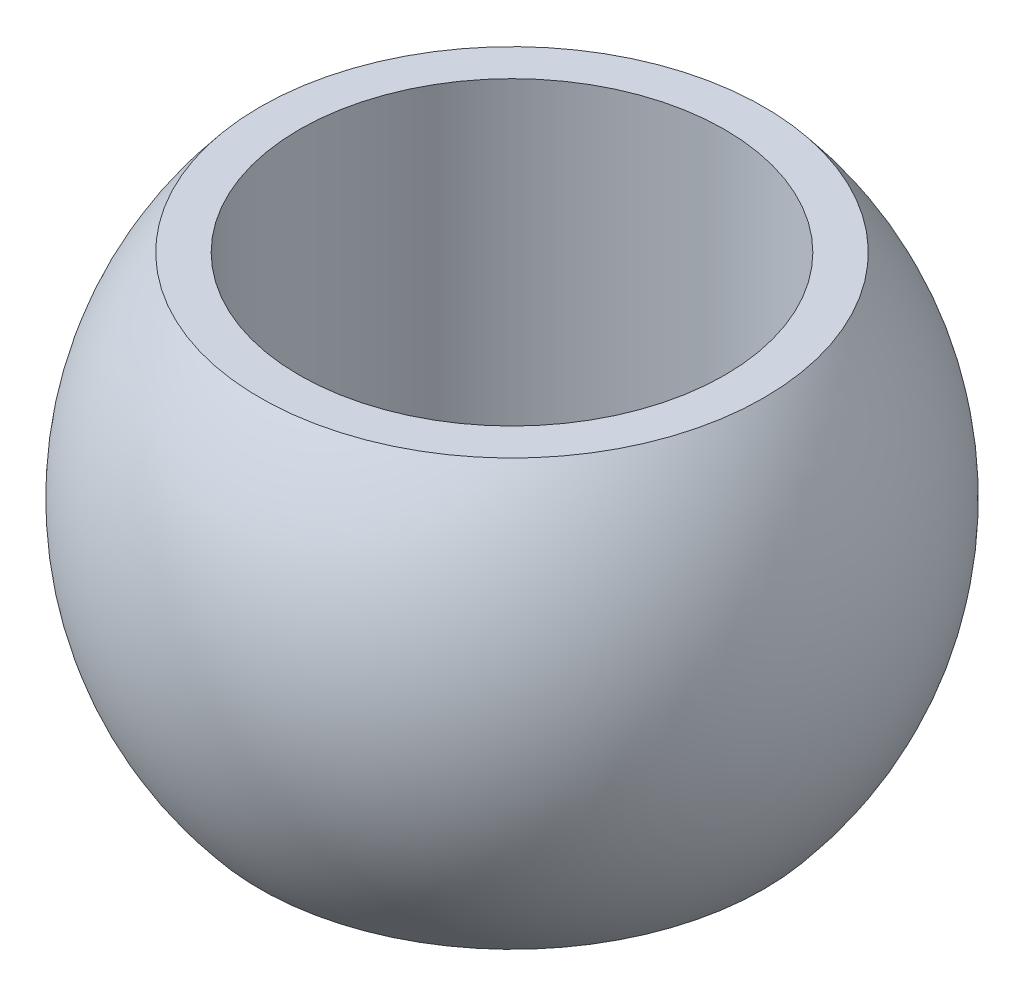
ISO-10303-21;
HEADER;
FILE_DESCRIPTION(('STEP AP214'),'2;1');
FILE_NAME('part.step','',(''),(''),'','','');
FILE_SCHEMA(('AUTOMOTIVE_DESIGN { 1 0 10303 214 1 1 1 1 }'));
ENDSEC;
DATA;
#1=APPLICATION_CONTEXT('core data for automotive mechanical design processes');
#2=APPLICATION_PROTOCOL_DEFINITION('international standard','automotive_design',2000,#1);
#3=PRODUCT_CONTEXT('',#1,'mechanical');
#4=PRODUCT('Part','Part','',(#3));
#5=PRODUCT_RELATED_PRODUCT_CATEGORY('part','',(#4));
#6=PRODUCT_DEFINITION_FORMATION('','',#4);
#7=PRODUCT_DEFINITION_CONTEXT('part definition',#1,'design');
#8=PRODUCT_DEFINITION('design','',#6,#7);
#9=PRODUCT_DEFINITION_SHAPE('','',#8);
#10=(LENGTH_UNIT() NAMED_UNIT(*) SI_UNIT(.MILLI.,.METRE.));
#11=(NAMED_UNIT(*) PLANE_ANGLE_UNIT() SI_UNIT($,.RADIAN.));
#12=(NAMED_UNIT(*) SI_UNIT($,.STERADIAN.) SOLID_ANGLE_UNIT());
#13=UNCERTAINTY_MEASURE_WITH_UNIT(LENGTH_MEASURE(1.E-05),#10,'distance_accuracy_value','');
#14=(GEOMETRIC_REPRESENTATION_CONTEXT(3) GLOBAL_UNCERTAINTY_ASSIGNED_CONTEXT((#13)) GLOBAL_UNIT_ASSIGNED_CONTEXT((#10,
#11,#12)) REPRESENTATION_CONTEXT('',''));
#15=CARTESIAN_POINT('',(0.,0.,0.));
#16=DIRECTION('',(0.,0.,1.));
#17=DIRECTION('',(1.,0.,0.));
#18=AXIS2_PLACEMENT_3D('',#15,#16,#17);
#19=CARTESIAN_POINT('',(0.,0.,0.));
#20=DIRECTION('',(0.,1.,0.));
#21=DIRECTION('',(1.,0.,0.));
#22=AXIS2_PLACEMENT_3D('',#19,#20,#21);
#23=SPHERICAL_SURFACE('',#22,12.303125);
#24=CARTESIAN_POINT('',(0.,7.9375,0.));
#25=DIRECTION('',(0.,1.,0.));
#26=DIRECTION('',(0.,0.,1.));
#27=AXIS2_PLACEMENT_3D('',#24,#25,#26);
#28=CIRCLE('',#27,9.40015843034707);
#29=CARTESIAN_POINT('',(9.40015843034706,7.9375,0.));
#30=VERTEX_POINT('',#29);
#31=EDGE_CURVE('E48',#30,#30,#28,.T.);
#32=CARTESIAN_POINT('',(0.,-7.9375,0.));
#33=DIRECTION('',(0.,1.,0.));
#34=DIRECTION('',(0.,0.,1.));
#35=AXIS2_PLACEMENT_3D('',#32,#33,#34);
#36=CIRCLE('',#35,9.40015843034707);
#37=CARTESIAN_POINT('',(9.40015843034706,-7.9375,0.));
#38=VERTEX_POINT('',#37);
#39=EDGE_CURVE('E10',#38,#38,#36,.T.);
#40=CARTESIAN_POINT('',(9.40015843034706,7.9375,0.));
#41=CARTESIAN_POINT('',(9.51611990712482,7.8001742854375,0.));
#42=CARTESIAN_POINT('',(9.62906784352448,7.66030420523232,0.));
#43=CARTESIAN_POINT('',(9.84872916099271,7.3757512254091,0.));
#44=CARTESIAN_POINT('',(9.95544254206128,7.23106832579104,0.));
#45=CARTESIAN_POINT('',(10.1624272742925,6.93716561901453,0.));
#46=CARTESIAN_POINT('',(10.2626986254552,6.78794581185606,0.));
#47=CARTESIAN_POINT('',(10.4566074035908,6.48525639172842,0.));
#48=CARTESIAN_POINT('',(10.5502448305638,6.33178677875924,0.));
#49=CARTESIAN_POINT('',(10.7307057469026,6.02089234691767,0.));
#50=CARTESIAN_POINT('',(10.8175292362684,5.86346752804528,0.));
#51=CARTESIAN_POINT('',(10.9841955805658,5.54496505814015,0.));
#52=CARTESIAN_POINT('',(11.0640384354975,5.38388740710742,0.));
#53=CARTESIAN_POINT('',(11.2165901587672,5.0583886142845,0.));
#54=CARTESIAN_POINT('',(11.2892990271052,4.89396747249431,0.));
#55=CARTESIAN_POINT('',(11.4274431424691,4.56209747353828,0.));
#56=CARTESIAN_POINT('',(11.4928783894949,4.39464861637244,0.));
#57=CARTESIAN_POINT('',(11.6163495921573,4.05704477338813,0.));
#58=CARTESIAN_POINT('',(11.6743855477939,3.88688978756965,0.));
#59=CARTESIAN_POINT('',(11.7829467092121,3.54420047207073,0.));
#60=CARTESIAN_POINT('',(11.8334719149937,3.37166614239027,0.));
#61=CARTESIAN_POINT('',(11.9269145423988,3.02454949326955,0.));
#62=CARTESIAN_POINT('',(11.9698319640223,2.84996717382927,0.));
#63=CARTESIAN_POINT('',(12.0479765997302,2.49908983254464,0.));
#64=CARTESIAN_POINT('',(12.0832038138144,2.32279481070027,0.));
#65=CARTESIAN_POINT('',(12.1459003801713,1.96883064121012,0.));
#66=CARTESIAN_POINT('',(12.1733697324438,1.79116149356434,0.));
#67=CARTESIAN_POINT('',(12.2204978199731,1.43479028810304,0.));
#68=CARTESIAN_POINT('',(12.2401565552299,1.25608823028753,0.));
#69=CARTESIAN_POINT('',(12.2716256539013,0.89799440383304,0.));
#70=CARTESIAN_POINT('',(12.283436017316,0.718602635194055,0.));
#71=CARTESIAN_POINT('',(12.2991856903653,0.359473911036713,0.));
#72=CARTESIAN_POINT('',(12.303125,0.179736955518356,0.));
#73=CARTESIAN_POINT('',(12.303125,-0.179736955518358,0.));
#74=CARTESIAN_POINT('',(12.2991856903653,-0.359473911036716,0.));
#75=CARTESIAN_POINT('',(12.283436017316,-0.718602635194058,0.));
#76=CARTESIAN_POINT('',(12.2716256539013,-0.897994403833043,0.));
#77=CARTESIAN_POINT('',(12.2401565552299,-1.25608823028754,0.));
#78=CARTESIAN_POINT('',(12.2204978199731,-1.43479028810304,0.));
#79=CARTESIAN_POINT('',(12.1733697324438,-1.79116149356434,0.));
#80=CARTESIAN_POINT('',(12.1459003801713,-1.96883064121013,0.));
#81=CARTESIAN_POINT('',(12.0832038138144,-2.32279481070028,0.));
#82=CARTESIAN_POINT('',(12.0479765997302,-2.49908983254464,0.));
#83=CARTESIAN_POINT('',(11.9698319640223,-2.84996717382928,0.));
#84=CARTESIAN_POINT('',(11.9269145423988,-3.02454949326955,0.));
#85=CARTESIAN_POINT('',(11.8334719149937,-3.37166614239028,0.));
#86=CARTESIAN_POINT('',(11.7829467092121,-3.54420047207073,0.));
#87=CARTESIAN_POINT('',(11.6743855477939,-3.88688978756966,0.));
#88=CARTESIAN_POINT('',(11.6163495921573,-4.05704477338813,0.));
#89=CARTESIAN_POINT('',(11.4928783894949,-4.39464861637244,0.));
#90=CARTESIAN_POINT('',(11.4274431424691,-4.56209747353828,0.));
#91=CARTESIAN_POINT('',(11.2892990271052,-4.89396747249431,0.));
#92=CARTESIAN_POINT('',(11.2165901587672,-5.0583886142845,0.));
#93=CARTESIAN_POINT('',(11.0640384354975,-5.38388740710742,0.));
#94=CARTESIAN_POINT('',(10.9841955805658,-5.54496505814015,0.));
#95=CARTESIAN_POINT('',(10.8175292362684,-5.86346752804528,0.));
#96=CARTESIAN_POINT('',(10.7307057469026,-6.02089234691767,0.));
#97=CARTESIAN_POINT('',(10.5502448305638,-6.33178677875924,0.));
#98=CARTESIAN_POINT('',(10.4566074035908,-6.48525639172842,0.));
#99=CARTESIAN_POINT('',(10.2626986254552,-6.78794581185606,0.));
#100=CARTESIAN_POINT('',(10.1624272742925,-6.93716561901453,0.));
#101=CARTESIAN_POINT('',(9.95544254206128,-7.23106832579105,0.));
#102=CARTESIAN_POINT('',(9.8487291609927,-7.3757512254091,0.));
#103=CARTESIAN_POINT('',(9.62906784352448,-7.66030420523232,0.));
#104=CARTESIAN_POINT('',(9.51611990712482,-7.8001742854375,0.));
#105=CARTESIAN_POINT('',(9.40015843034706,-7.9375,0.));
#106=B_SPLINE_CURVE_WITH_KNOTS('',3,(#40,#41,#42,#43,#44,#45,#46,#47,#48,#49,#50,#51,#52,#53,
#54,#55,#56,#57,#58,#59,#60,#61,#62,#63,#64,#65,#66,#67,#68,#69,#70,#71,#72,#73,#74,#75,#76,#77,
#78,#79,#80,#81,#82,#83,#84,#85,#86,#87,#88,#89,#90,#91,#92,#93,#94,#95,#96,#97,#98,#99,#100,
#101,#102,#103,#104,#105),.UNSPECIFIED.,.F.,.F.,(4,2,2,2,2,2,2,2,2,2,2,2,2,2,2,2,2,2,2,2,2,2,2,
2,2,2,2,2,2,2,2,2,4),(0.,0.539167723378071,1.07833544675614,1.61750317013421,2.15667089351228,
2.69583861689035,3.23500634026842,3.77417406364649,4.31334178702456,4.85250951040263,
5.3916772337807,5.93084495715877,6.47001268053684,7.00918040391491,7.54834812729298,
8.08751585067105,8.62668357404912,9.16585129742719,9.70501902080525,10.2441867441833,
10.7833544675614,11.3225221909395,11.8616899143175,12.4008576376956,12.9400253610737,
13.4791930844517,14.0183608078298,14.5575285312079,15.0966962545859,15.635863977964,
16.1750317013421,16.7141994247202,17.2533671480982),.UNSPECIFIED.);
#107=EDGE_CURVE('BSEAM34',#30,#38,#106,.T.);
#108=ORIENTED_EDGE('',*,*,#31,.F.);
#109=ORIENTED_EDGE('',*,*,#39,.T.);
#110=ORIENTED_EDGE('',*,*,#107,.T.);
#111=ORIENTED_EDGE('',*,*,#107,.F.);
#112=EDGE_LOOP('',(#108,#110,#109,#111));
#113=FACE_BOUND('',#112,.T.);
#114=ADVANCED_FACE('F34',(#113),#23,.T.);
#115=CARTESIAN_POINT('',(7.9375,-7.9375,0.));
#116=DIRECTION('',(0.,1.,0.));
#117=DIRECTION('',(0.,0.,1.));
#118=AXIS2_PLACEMENT_3D('',#115,#116,#117);
#119=PLANE('',#118);
#120=ORIENTED_EDGE('',*,*,#39,.F.);
#121=EDGE_LOOP('',(#120));
#122=FACE_BOUND('',#121,.T.);
#123=CARTESIAN_POINT('',(0.,-7.9375,0.));
#124=DIRECTION('',(0.,1.,0.));
#125=DIRECTION('',(0.,0.,1.));
#126=AXIS2_PLACEMENT_3D('',#123,#124,#125);
#127=CIRCLE('',#126,7.9375);
#128=CARTESIAN_POINT('',(0.,-7.9375,7.9375));
#129=VERTEX_POINT('',#128);
#130=EDGE_CURVE('E40',#129,#129,#127,.T.);
#131=ORIENTED_EDGE('',*,*,#130,.T.);
#132=EDGE_LOOP('',(#131));
#133=FACE_BOUND('',#132,.T.);
#134=ADVANCED_FACE('F57',(#122,#133),#119,.F.);
#135=CARTESIAN_POINT('',(0.,55.,0.));
#136=DIRECTION('',(0.,1.,0.));
#137=DIRECTION('',(0.,0.,1.));
#138=AXIS2_PLACEMENT_3D('',#135,#136,#137);
#139=CYLINDRICAL_SURFACE('',#138,7.9375);
#140=ORIENTED_EDGE('',*,*,#130,.F.);
#141=EDGE_LOOP('',(#140));
#142=FACE_BOUND('',#141,.T.);
#143=CARTESIAN_POINT('',(0.,7.9375,0.));
#144=DIRECTION('',(0.,1.,0.));
#145=DIRECTION('',(0.,0.,1.));
#146=AXIS2_PLACEMENT_3D('',#143,#144,#145);
#147=CIRCLE('',#146,7.9375);
#148=CARTESIAN_POINT('',(0.,7.9375,7.9375));
#149=VERTEX_POINT('',#148);
#150=EDGE_CURVE('E44',#149,#149,#147,.T.);
#151=ORIENTED_EDGE('',*,*,#150,.T.);
#152=EDGE_LOOP('',(#151));
#153=FACE_BOUND('',#152,.T.);
#154=ADVANCED_FACE('F61',(#142,#153),#139,.F.);
#155=CARTESIAN_POINT('',(9.40015843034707,7.9375,0.));
#156=DIRECTION('',(0.,-1.,0.));
#157=DIRECTION('',(0.,0.,-1.));
#158=AXIS2_PLACEMENT_3D('',#155,#156,#157);
#159=PLANE('',#158);
#160=ORIENTED_EDGE('',*,*,#150,.F.);
#161=EDGE_LOOP('',(#160));
#162=FACE_BOUND('',#161,.T.);
#163=ORIENTED_EDGE('',*,*,#31,.T.);
#164=EDGE_LOOP('',(#163));
#165=FACE_BOUND('',#164,.T.);
#166=ADVANCED_FACE('F54',(#162,#165),#159,.F.);
#167=CLOSED_SHELL('',(#114,#134,#154,#166));
#168=MANIFOLD_SOLID_BREP('B2',#167);
#169=ADVANCED_BREP_SHAPE_REPRESENTATION('',(#18,#168),#14);
#170=SHAPE_DEFINITION_REPRESENTATION(#9,#169);
ENDSEC;
END-ISO-10303-21;
